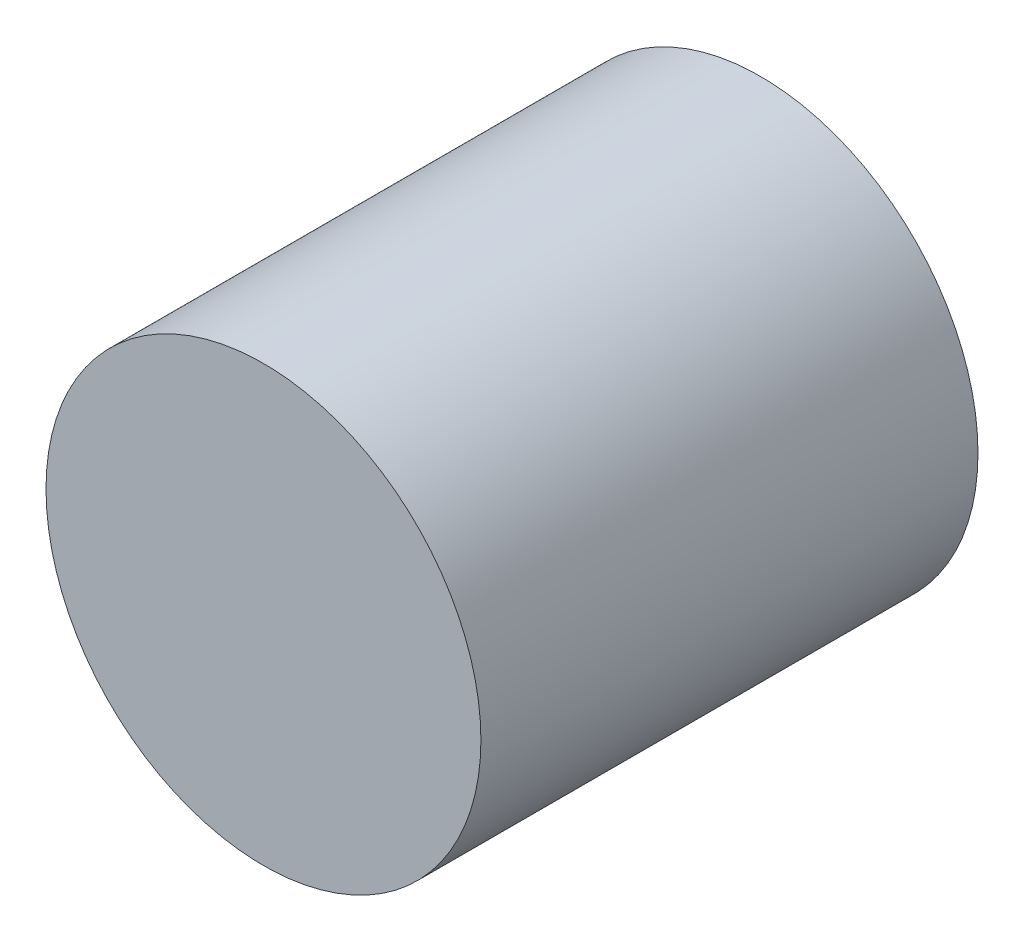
from build123d import *

# Parameters (mm, degrees)
SKETCH_1_R      = 17.5006
EXTRUDE_1_DEPTH = 40.005
SKETCH_2_R      = 0.889
EXTRUDE_2_DEPTH = 2.54


with BuildPart() as part:
    # Sketch 1 → Extrude 1 (new body)
    with BuildSketch(Plane.XY):
        Circle(SKETCH_1_R)
    extrude(amount=EXTRUDE_1_DEPTH)

    # Sketch 2 → Extrude 2 (add)
    with BuildSketch(Plane(origin=(0, 0, 0), x_dir=(-1, 0, 0), z_dir=(0, 0, -1))):
        with Locations(Location((0, 5.08, 0), (0, 0, 180))):
            Circle(SKETCH_2_R)
        with Locations(Location((0, -5.08, 0), (0, 0, 180))):
            Circle(SKETCH_2_R)
    extrude(amount=EXTRUDE_2_DEPTH)


solid = part.part
